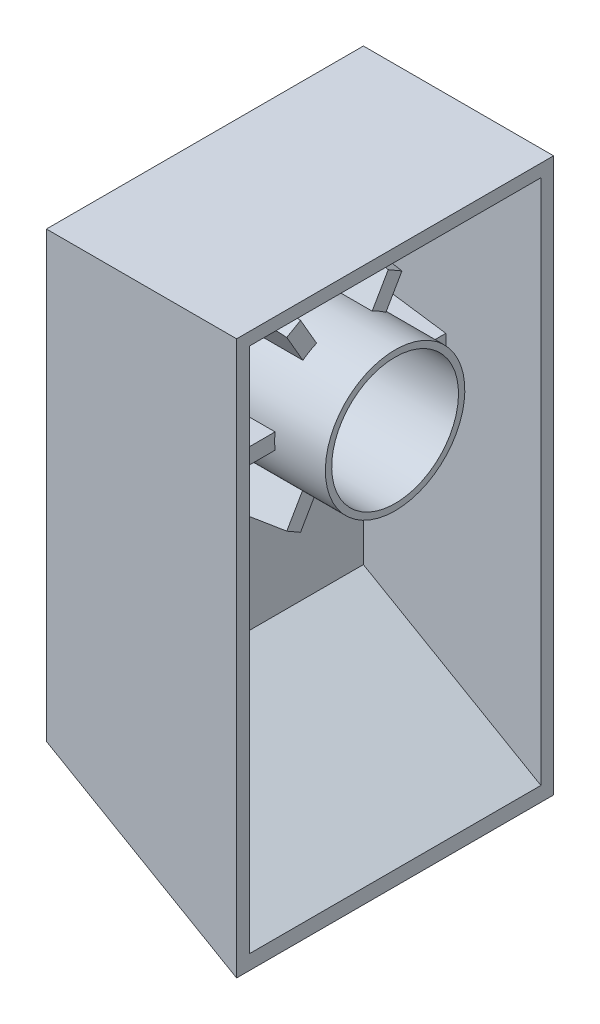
ISO-10303-21;
HEADER;
FILE_DESCRIPTION(('STEP AP214'),'2;1');
FILE_NAME('part.step','',(''),(''),'','','');
FILE_SCHEMA(('AUTOMOTIVE_DESIGN { 1 0 10303 214 1 1 1 1 }'));
ENDSEC;
DATA;
#1=APPLICATION_CONTEXT('core data for automotive mechanical design processes');
#2=APPLICATION_PROTOCOL_DEFINITION('international standard','automotive_design',2000,#1);
#3=PRODUCT_CONTEXT('',#1,'mechanical');
#4=PRODUCT('Part','Part','',(#3));
#5=PRODUCT_RELATED_PRODUCT_CATEGORY('part','',(#4));
#6=PRODUCT_DEFINITION_FORMATION('','',#4);
#7=PRODUCT_DEFINITION_CONTEXT('part definition',#1,'design');
#8=PRODUCT_DEFINITION('design','',#6,#7);
#9=PRODUCT_DEFINITION_SHAPE('','',#8);
#10=(LENGTH_UNIT() NAMED_UNIT(*) SI_UNIT(.MILLI.,.METRE.));
#11=(NAMED_UNIT(*) PLANE_ANGLE_UNIT() SI_UNIT($,.RADIAN.));
#12=(NAMED_UNIT(*) SI_UNIT($,.STERADIAN.) SOLID_ANGLE_UNIT());
#13=UNCERTAINTY_MEASURE_WITH_UNIT(LENGTH_MEASURE(1.E-05),#10,'distance_accuracy_value','');
#14=(GEOMETRIC_REPRESENTATION_CONTEXT(3) GLOBAL_UNCERTAINTY_ASSIGNED_CONTEXT((#13)) GLOBAL_UNIT_ASSIGNED_CONTEXT((#10,
#11,#12)) REPRESENTATION_CONTEXT('',''));
#15=CARTESIAN_POINT('',(0.,0.,0.));
#16=DIRECTION('',(0.,0.,1.));
#17=DIRECTION('',(1.,0.,0.));
#18=AXIS2_PLACEMENT_3D('',#15,#16,#17);
#19=CARTESIAN_POINT('',(60.,140.,50.));
#20=DIRECTION('',(-1.,0.,0.));
#21=DIRECTION('',(0.,-1.,0.));
#22=AXIS2_PLACEMENT_3D('',#19,#20,#21);
#23=PLANE('',#22);
#24=DIRECTION('',(0.,1.,0.));
#25=VECTOR('',#24,1.);
#26=CARTESIAN_POINT('',(60.,140.,-50.));
#27=LINE('',#26,#25);
#28=CARTESIAN_POINT('',(60.,-34.6410161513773,-50.));
#29=VERTEX_POINT('',#28);
#30=CARTESIAN_POINT('',(60.,140.,-50.));
#31=VERTEX_POINT('',#30);
#32=EDGE_CURVE('E446',#29,#31,#27,.T.);
#33=ORIENTED_EDGE('',*,*,#32,.T.);
#34=DIRECTION('',(0.,0.,-1.));
#35=VECTOR('',#34,1.);
#36=CARTESIAN_POINT('',(60.,140.,50.));
#37=LINE('',#36,#35);
#38=CARTESIAN_POINT('',(60.,140.,50.));
#39=VERTEX_POINT('',#38);
#40=EDGE_CURVE('E456',#39,#31,#37,.T.);
#41=ORIENTED_EDGE('',*,*,#40,.F.);
#42=DIRECTION('',(0.,1.,0.));
#43=VECTOR('',#42,1.);
#44=CARTESIAN_POINT('',(60.,140.,50.));
#45=LINE('',#44,#43);
#46=CARTESIAN_POINT('',(60.,-34.6410161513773,50.));
#47=VERTEX_POINT('',#46);
#48=EDGE_CURVE('E437',#47,#39,#45,.T.);
#49=ORIENTED_EDGE('',*,*,#48,.F.);
#50=DIRECTION('',(0.,0.,-1.));
#51=VECTOR('',#50,1.);
#52=CARTESIAN_POINT('',(60.,-34.6410161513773,50.));
#53=LINE('',#52,#51);
#54=EDGE_CURVE('E459',#47,#29,#53,.T.);
#55=ORIENTED_EDGE('',*,*,#54,.T.);
#56=EDGE_LOOP('',(#33,#41,#49,#55));
#57=FACE_BOUND('',#56,.T.);
#58=DIRECTION('',(0.,1.,0.));
#59=VECTOR('',#58,1.);
#60=CARTESIAN_POINT('',(60.,0.,-46.));
#61=LINE('',#60,#59);
#62=CARTESIAN_POINT('',(60.,-30.0222139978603,-46.));
#63=VERTEX_POINT('',#62);
#64=CARTESIAN_POINT('',(60.,136.,-46.));
#65=VERTEX_POINT('',#64);
#66=EDGE_CURVE('E395',#63,#65,#61,.T.);
#67=ORIENTED_EDGE('',*,*,#66,.F.);
#68=DIRECTION('',(0.,0.,-1.));
#69=VECTOR('',#68,1.);
#70=CARTESIAN_POINT('',(60.,-30.0222139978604,50.));
#71=LINE('',#70,#69);
#72=CARTESIAN_POINT('',(60.,-30.0222139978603,46.));
#73=VERTEX_POINT('',#72);
#74=EDGE_CURVE('E419',#73,#63,#71,.T.);
#75=ORIENTED_EDGE('',*,*,#74,.F.);
#76=DIRECTION('',(0.,1.,0.));
#77=VECTOR('',#76,1.);
#78=CARTESIAN_POINT('',(60.,0.,46.));
#79=LINE('',#78,#77);
#80=CARTESIAN_POINT('',(60.,136.,46.));
#81=VERTEX_POINT('',#80);
#82=EDGE_CURVE('E399',#73,#81,#79,.T.);
#83=ORIENTED_EDGE('',*,*,#82,.T.);
#84=DIRECTION('',(0.,0.,-1.));
#85=VECTOR('',#84,1.);
#86=CARTESIAN_POINT('',(60.,136.,50.));
#87=LINE('',#86,#85);
#88=EDGE_CURVE('E415',#81,#65,#87,.T.);
#89=ORIENTED_EDGE('',*,*,#88,.T.);
#90=EDGE_LOOP('',(#67,#75,#83,#89));
#91=FACE_BOUND('',#90,.T.);
#92=ADVANCED_FACE('F44',(#57,#91),#23,.F.);
#93=CARTESIAN_POINT('',(60.,-34.6410161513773,50.));
#94=DIRECTION('',(0.499999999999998,0.86602540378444,0.));
#95=DIRECTION('',(-0.86602540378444,0.499999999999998,0.));
#96=AXIS2_PLACEMENT_3D('',#93,#94,#95);
#97=PLANE('',#96);
#98=DIRECTION('',(0.,0.,-1.));
#99=VECTOR('',#98,1.);
#100=CARTESIAN_POINT('',(0.,0.,50.));
#101=LINE('',#100,#99);
#102=CARTESIAN_POINT('',(0.,0.,50.));
#103=VERTEX_POINT('',#102);
#104=CARTESIAN_POINT('',(0.,0.,-50.));
#105=VERTEX_POINT('',#104);
#106=EDGE_CURVE('E444',#103,#105,#101,.T.);
#107=ORIENTED_EDGE('',*,*,#106,.T.);
#108=DIRECTION('',(0.86602540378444,-0.499999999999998,0.));
#109=VECTOR('',#108,1.);
#110=CARTESIAN_POINT('',(60.,-34.6410161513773,-50.));
#111=LINE('',#110,#109);
#112=EDGE_CURVE('E432',#105,#29,#111,.T.);
#113=ORIENTED_EDGE('',*,*,#112,.T.);
#114=ORIENTED_EDGE('',*,*,#54,.F.);
#115=DIRECTION('',(0.86602540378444,-0.499999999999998,0.));
#116=VECTOR('',#115,1.);
#117=CARTESIAN_POINT('',(60.,-34.6410161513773,50.));
#118=LINE('',#117,#116);
#119=EDGE_CURVE('E435',#103,#47,#118,.T.);
#120=ORIENTED_EDGE('',*,*,#119,.F.);
#121=EDGE_LOOP('',(#107,#113,#114,#120));
#122=FACE_BOUND('',#121,.T.);
#123=ADVANCED_FACE('F46',(#122),#97,.F.);
#124=CARTESIAN_POINT('',(60.,90.,0.));
#125=DIRECTION('',(-1.,0.,0.));
#126=DIRECTION('',(0.,-1.,0.));
#127=AXIS2_PLACEMENT_3D('',#124,#125,#126);
#128=CIRCLE('',#127,22.);
#129=CARTESIAN_POINT('',(60.,68.,0.));
#130=VERTEX_POINT('',#129);
#131=EDGE_CURVE('E391',#130,#130,#128,.F.);
#132=ORIENTED_EDGE('',*,*,#131,.T.);
#133=EDGE_LOOP('',(#132));
#134=FACE_BOUND('',#133,.T.);
#135=CARTESIAN_POINT('',(60.,90.,0.));
#136=DIRECTION('',(1.,0.,0.));
#137=DIRECTION('',(0.,1.,0.));
#138=AXIS2_PLACEMENT_3D('',#135,#136,#137);
#139=CIRCLE('',#138,20.);
#140=CARTESIAN_POINT('',(60.,110.,0.));
#141=VERTEX_POINT('',#140);
#142=EDGE_CURVE('E421',#141,#141,#139,.T.);
#143=ORIENTED_EDGE('',*,*,#142,.F.);
#144=EDGE_LOOP('',(#143));
#145=FACE_BOUND('',#144,.T.);
#146=ADVANCED_FACE('F588',(#134,#145),#23,.F.);
#147=CARTESIAN_POINT('',(0.,140.,50.));
#148=DIRECTION('',(0.,-1.,0.));
#149=DIRECTION('',(0.,0.,-1.));
#150=AXIS2_PLACEMENT_3D('',#147,#148,#149);
#151=PLANE('',#150);
#152=DIRECTION('',(-1.,0.,0.));
#153=VECTOR('',#152,1.);
#154=CARTESIAN_POINT('',(0.,140.,-50.));
#155=LINE('',#154,#153);
#156=CARTESIAN_POINT('',(0.,140.,-50.));
#157=VERTEX_POINT('',#156);
#158=EDGE_CURVE('E448',#31,#157,#155,.T.);
#159=ORIENTED_EDGE('',*,*,#158,.T.);
#160=DIRECTION('',(0.,0.,-1.));
#161=VECTOR('',#160,1.);
#162=CARTESIAN_POINT('',(0.,140.,50.));
#163=LINE('',#162,#161);
#164=CARTESIAN_POINT('',(0.,140.,50.));
#165=VERTEX_POINT('',#164);
#166=EDGE_CURVE('E454',#165,#157,#163,.T.);
#167=ORIENTED_EDGE('',*,*,#166,.F.);
#168=DIRECTION('',(-1.,0.,0.));
#169=VECTOR('',#168,1.);
#170=CARTESIAN_POINT('',(0.,140.,50.));
#171=LINE('',#170,#169);
#172=EDGE_CURVE('E440',#39,#165,#171,.T.);
#173=ORIENTED_EDGE('',*,*,#172,.F.);
#174=ORIENTED_EDGE('',*,*,#40,.T.);
#175=EDGE_LOOP('',(#159,#167,#173,#174));
#176=FACE_BOUND('',#175,.T.);
#177=ADVANCED_FACE('F596',(#176),#151,.F.);
#178=CARTESIAN_POINT('',(0.,0.,50.));
#179=DIRECTION('',(1.,0.,0.));
#180=DIRECTION('',(0.,0.,-1.));
#181=AXIS2_PLACEMENT_3D('',#178,#179,#180);
#182=PLANE('',#181);
#183=CARTESIAN_POINT('',(0.,90.,0.));
#184=DIRECTION('',(1.,0.,0.));
#185=DIRECTION('',(0.,1.,0.));
#186=AXIS2_PLACEMENT_3D('',#183,#184,#185);
#187=CIRCLE('',#186,20.);
#188=CARTESIAN_POINT('',(0.,110.,0.));
#189=VERTEX_POINT('',#188);
#190=EDGE_CURVE('E429',#189,#189,#187,.T.);
#191=ORIENTED_EDGE('',*,*,#190,.T.);
#192=EDGE_LOOP('',(#191));
#193=FACE_BOUND('',#192,.T.);
#194=ORIENTED_EDGE('',*,*,#166,.T.);
#195=DIRECTION('',(0.,-1.,0.));
#196=VECTOR('',#195,1.);
#197=CARTESIAN_POINT('',(0.,0.,-50.));
#198=LINE('',#197,#196);
#199=EDGE_CURVE('E438',#157,#105,#198,.T.);
#200=ORIENTED_EDGE('',*,*,#199,.T.);
#201=ORIENTED_EDGE('',*,*,#106,.F.);
#202=DIRECTION('',(0.,-1.,0.));
#203=VECTOR('',#202,1.);
#204=CARTESIAN_POINT('',(0.,0.,50.));
#205=LINE('',#204,#203);
#206=EDGE_CURVE('E442',#165,#103,#205,.T.);
#207=ORIENTED_EDGE('',*,*,#206,.F.);
#208=EDGE_LOOP('',(#194,#200,#201,#207));
#209=FACE_BOUND('',#208,.T.);
#210=ADVANCED_FACE('F601',(#193,#209),#182,.F.);
#211=CARTESIAN_POINT('',(0.,0.,50.));
#212=DIRECTION('',(0.,0.,-1.));
#213=DIRECTION('',(-1.,0.,0.));
#214=AXIS2_PLACEMENT_3D('',#211,#212,#213);
#215=PLANE('',#214);
#216=ORIENTED_EDGE('',*,*,#206,.T.);
#217=ORIENTED_EDGE('',*,*,#119,.T.);
#218=ORIENTED_EDGE('',*,*,#48,.T.);
#219=ORIENTED_EDGE('',*,*,#172,.T.);
#220=EDGE_LOOP('',(#216,#217,#218,#219));
#221=FACE_BOUND('',#220,.T.);
#222=ADVANCED_FACE('F620',(#221),#215,.F.);
#223=CARTESIAN_POINT('',(0.,0.,-50.));
#224=DIRECTION('',(0.,0.,-1.));
#225=DIRECTION('',(-1.,0.,0.));
#226=AXIS2_PLACEMENT_3D('',#223,#224,#225);
#227=PLANE('',#226);
#228=ORIENTED_EDGE('',*,*,#112,.F.);
#229=ORIENTED_EDGE('',*,*,#199,.F.);
#230=ORIENTED_EDGE('',*,*,#158,.F.);
#231=ORIENTED_EDGE('',*,*,#32,.F.);
#232=EDGE_LOOP('',(#228,#229,#230,#231));
#233=FACE_BOUND('',#232,.T.);
#234=ADVANCED_FACE('F610',(#233),#227,.T.);
#235=CARTESIAN_POINT('',(0.,90.,0.));
#236=DIRECTION('',(1.,0.,0.));
#237=DIRECTION('',(0.,1.,0.));
#238=AXIS2_PLACEMENT_3D('',#235,#236,#237);
#239=CYLINDRICAL_SURFACE('',#238,20.);
#240=ORIENTED_EDGE('',*,*,#190,.F.);
#241=EDGE_LOOP('',(#240));
#242=FACE_BOUND('',#241,.T.);
#243=ORIENTED_EDGE('',*,*,#142,.T.);
#244=EDGE_LOOP('',(#243));
#245=FACE_BOUND('',#244,.T.);
#246=ADVANCED_FACE('F607',(#242,#245),#239,.F.);
#247=CARTESIAN_POINT('',(62.,-31.1769145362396,50.));
#248=DIRECTION('',(0.499999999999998,0.86602540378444,0.));
#249=DIRECTION('',(-0.86602540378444,0.499999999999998,0.));
#250=AXIS2_PLACEMENT_3D('',#247,#248,#249);
#251=PLANE('',#250);
#252=DIRECTION('',(0.86602540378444,-0.499999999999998,0.));
#253=VECTOR('',#252,1.);
#254=CARTESIAN_POINT('',(1.99999999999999,3.46410161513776,-46.));
#255=LINE('',#254,#253);
#256=CARTESIAN_POINT('',(4.,2.30940107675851,-46.));
#257=VERTEX_POINT('',#256);
#258=EDGE_CURVE('E392',#257,#63,#255,.T.);
#259=ORIENTED_EDGE('',*,*,#258,.F.);
#260=DIRECTION('',(0.,0.,-1.));
#261=VECTOR('',#260,1.);
#262=CARTESIAN_POINT('',(4.,2.30940107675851,50.));
#263=LINE('',#262,#261);
#264=CARTESIAN_POINT('',(4.,2.30940107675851,46.));
#265=VERTEX_POINT('',#264);
#266=EDGE_CURVE('E401',#265,#257,#263,.T.);
#267=ORIENTED_EDGE('',*,*,#266,.F.);
#268=DIRECTION('',(0.86602540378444,-0.499999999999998,0.));
#269=VECTOR('',#268,1.);
#270=CARTESIAN_POINT('',(1.99999999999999,3.46410161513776,46.));
#271=LINE('',#270,#269);
#272=EDGE_CURVE('E397',#265,#73,#271,.T.);
#273=ORIENTED_EDGE('',*,*,#272,.T.);
#274=ORIENTED_EDGE('',*,*,#74,.T.);
#275=EDGE_LOOP('',(#259,#267,#273,#274));
#276=FACE_BOUND('',#275,.T.);
#277=ADVANCED_FACE('F609',(#276),#251,.T.);
#278=CARTESIAN_POINT('',(0.,136.,50.));
#279=DIRECTION('',(0.,-1.,0.));
#280=DIRECTION('',(0.,0.,-1.));
#281=AXIS2_PLACEMENT_3D('',#278,#279,#280);
#282=PLANE('',#281);
#283=DIRECTION('',(0.,0.,-1.));
#284=VECTOR('',#283,1.);
#285=CARTESIAN_POINT('',(4.,136.,50.));
#286=LINE('',#285,#284);
#287=CARTESIAN_POINT('',(4.,136.,46.));
#288=VERTEX_POINT('',#287);
#289=CARTESIAN_POINT('',(4.,136.,-46.));
#290=VERTEX_POINT('',#289);
#291=EDGE_CURVE('E404',#288,#290,#286,.T.);
#292=ORIENTED_EDGE('',*,*,#291,.T.);
#293=DIRECTION('',(-1.,0.,0.));
#294=VECTOR('',#293,1.);
#295=CARTESIAN_POINT('',(0.,136.,-46.));
#296=LINE('',#295,#294);
#297=EDGE_CURVE('E411',#65,#290,#296,.T.);
#298=ORIENTED_EDGE('',*,*,#297,.F.);
#299=ORIENTED_EDGE('',*,*,#88,.F.);
#300=DIRECTION('',(-1.,0.,0.));
#301=VECTOR('',#300,1.);
#302=CARTESIAN_POINT('',(0.,136.,46.));
#303=LINE('',#302,#301);
#304=EDGE_CURVE('E413',#81,#288,#303,.T.);
#305=ORIENTED_EDGE('',*,*,#304,.T.);
#306=EDGE_LOOP('',(#292,#298,#299,#305));
#307=FACE_BOUND('',#306,.T.);
#308=ADVANCED_FACE('F617',(#307),#282,.T.);
#309=CARTESIAN_POINT('',(4.,0.,50.));
#310=DIRECTION('',(1.,0.,0.));
#311=DIRECTION('',(0.,0.,-1.));
#312=AXIS2_PLACEMENT_3D('',#309,#310,#311);
#313=PLANE('',#312);
#314=DIRECTION('',(0.,-1.,0.));
#315=VECTOR('',#314,1.);
#316=CARTESIAN_POINT('',(4.,0.,-46.));
#317=LINE('',#316,#315);
#318=EDGE_CURVE('E400',#290,#257,#317,.T.);
#319=ORIENTED_EDGE('',*,*,#318,.F.);
#320=ORIENTED_EDGE('',*,*,#291,.F.);
#321=DIRECTION('',(0.,-1.,0.));
#322=VECTOR('',#321,1.);
#323=CARTESIAN_POINT('',(4.,0.,46.));
#324=LINE('',#323,#322);
#325=EDGE_CURVE('E405',#288,#265,#324,.T.);
#326=ORIENTED_EDGE('',*,*,#325,.T.);
#327=ORIENTED_EDGE('',*,*,#266,.T.);
#328=EDGE_LOOP('',(#319,#320,#326,#327));
#329=FACE_BOUND('',#328,.T.);
#330=DIRECTION('',(0.,-0.500000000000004,0.866025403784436));
#331=VECTOR('',#330,1.);
#332=CARTESIAN_POINT('',(4.,77.8923048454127,94.9711431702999));
#333=LINE('',#332,#331);
#334=CARTESIAN_POINT('',(4.00000000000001,123.292939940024,16.3349364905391));
#335=VERTEX_POINT('',#334);
#336=CARTESIAN_POINT('',(4.00000000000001,120.792939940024,20.6650635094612));
#337=VERTEX_POINT('',#336);
#338=EDGE_CURVE('E490',#335,#337,#333,.T.);
#339=ORIENTED_EDGE('',*,*,#338,.F.);
#340=DIRECTION('',(0.,-0.866025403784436,-0.500000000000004));
#341=VECTOR('',#340,1.);
#342=CARTESIAN_POINT('',(4.,45.4006350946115,-28.6362066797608));
#343=LINE('',#342,#341);
#344=CARTESIAN_POINT('',(4.,110.179144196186,8.76368298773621));
#345=VERTEX_POINT('',#344);
#346=EDGE_CURVE('E350',#335,#345,#343,.T.);
#347=ORIENTED_EDGE('',*,*,#346,.T.);
#348=CARTESIAN_POINT('',(4.,90.,0.));
#349=DIRECTION('',(1.,0.,0.));
#350=DIRECTION('',(0.,0.,-1.));
#351=AXIS2_PLACEMENT_3D('',#348,#349,#350);
#352=CIRCLE('',#351,22.);
#353=CARTESIAN_POINT('',(4.,110.179144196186,-8.76368298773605));
#354=VERTEX_POINT('',#353);
#355=EDGE_CURVE('E408',#354,#345,#352,.T.);
#356=ORIENTED_EDGE('',*,*,#355,.F.);
#357=DIRECTION('',(0.,-0.86602540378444,0.499999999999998));
#358=VECTOR('',#357,1.);
#359=CARTESIAN_POINT('',(4.,2.09936490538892,53.6362066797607));
#360=LINE('',#359,#358);
#361=CARTESIAN_POINT('',(4.,123.292939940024,-16.3349364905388));
#362=VERTEX_POINT('',#361);
#363=EDGE_CURVE('E371',#362,#354,#360,.T.);
#364=ORIENTED_EDGE('',*,*,#363,.F.);
#365=DIRECTION('',(0.,0.499999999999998,0.86602540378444));
#366=VECTOR('',#365,1.);
#367=CARTESIAN_POINT('',(4.,121.193575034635,-19.9711431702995));
#368=LINE('',#367,#366);
#369=CARTESIAN_POINT('',(4.,120.792939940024,-20.665063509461));
#370=VERTEX_POINT('',#369);
#371=EDGE_CURVE('E480',#370,#362,#368,.T.);
#372=ORIENTED_EDGE('',*,*,#371,.F.);
#373=DIRECTION('',(0.,-0.86602540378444,0.499999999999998));
#374=VECTOR('',#373,1.);
#375=CARTESIAN_POINT('',(4.,-0.400635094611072,49.3060796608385));
#376=LINE('',#375,#374);
#377=CARTESIAN_POINT('',(4.,107.679144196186,-13.0938100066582));
#378=VERTEX_POINT('',#377);
#379=EDGE_CURVE('E368',#370,#378,#376,.T.);
#380=ORIENTED_EDGE('',*,*,#379,.T.);
#381=CARTESIAN_POINT('',(4.,92.5,-21.8574929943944));
#382=VERTEX_POINT('',#381);
#383=EDGE_CURVE('E396',#382,#378,#352,.T.);
#384=ORIENTED_EDGE('',*,*,#383,.F.);
#385=DIRECTION('',(0.,0.,1.));
#386=VECTOR('',#385,1.);
#387=CARTESIAN_POINT('',(4.,92.5,50.));
#388=LINE('',#387,#386);
#389=CARTESIAN_POINT('',(4.,92.5,-37.));
#390=VERTEX_POINT('',#389);
#391=EDGE_CURVE('E389',#390,#382,#388,.T.);
#392=ORIENTED_EDGE('',*,*,#391,.F.);
#393=DIRECTION('',(0.,1.,0.));
#394=VECTOR('',#393,1.);
#395=CARTESIAN_POINT('',(4.,0.,-37.));
#396=LINE('',#395,#394);
#397=CARTESIAN_POINT('',(4.,87.5,-37.));
#398=VERTEX_POINT('',#397);
#399=EDGE_CURVE('E470',#398,#390,#396,.T.);
#400=ORIENTED_EDGE('',*,*,#399,.F.);
#401=DIRECTION('',(0.,0.,1.));
#402=VECTOR('',#401,1.);
#403=CARTESIAN_POINT('',(4.,87.5,50.));
#404=LINE('',#403,#402);
#405=CARTESIAN_POINT('',(4.,87.5,-21.8574929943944));
#406=VERTEX_POINT('',#405);
#407=EDGE_CURVE('E386',#398,#406,#404,.T.);
#408=ORIENTED_EDGE('',*,*,#407,.T.);
#409=CARTESIAN_POINT('',(4.,72.3208558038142,-13.0938100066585));
#410=VERTEX_POINT('',#409);
#411=EDGE_CURVE('E409',#410,#406,#352,.T.);
#412=ORIENTED_EDGE('',*,*,#411,.F.);
#413=DIRECTION('',(0.,0.866025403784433,0.50000000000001));
#414=VECTOR('',#413,1.);
#415=CARTESIAN_POINT('',(4.,45.4006350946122,-28.6362066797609));
#416=LINE('',#415,#414);
#417=CARTESIAN_POINT('',(4.,59.207060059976,-20.6650635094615));
#418=VERTEX_POINT('',#417);
#419=EDGE_CURVE('E276',#418,#410,#416,.T.);
#420=ORIENTED_EDGE('',*,*,#419,.F.);
#421=DIRECTION('',(0.,0.50000000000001,-0.866025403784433));
#422=VECTOR('',#421,1.);
#423=CARTESIAN_POINT('',(4.,13.8064249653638,57.9711431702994));
#424=LINE('',#423,#422);
#425=CARTESIAN_POINT('',(4.,56.707060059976,-16.3349364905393));
#426=VERTEX_POINT('',#425);
#427=EDGE_CURVE('E13',#426,#418,#424,.T.);
#428=ORIENTED_EDGE('',*,*,#427,.F.);
#429=DIRECTION('',(0.,0.866025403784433,0.50000000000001));
#430=VECTOR('',#429,1.);
#431=CARTESIAN_POINT('',(4.,42.9006350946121,-24.3060796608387));
#432=LINE('',#431,#430);
#433=CARTESIAN_POINT('',(4.,69.8208558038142,-8.76368298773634));
#434=VERTEX_POINT('',#433);
#435=EDGE_CURVE('E282',#426,#434,#432,.T.);
#436=ORIENTED_EDGE('',*,*,#435,.T.);
#437=CARTESIAN_POINT('',(4.,69.820855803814,8.76368298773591));
#438=VERTEX_POINT('',#437);
#439=EDGE_CURVE('E508',#438,#434,#352,.T.);
#440=ORIENTED_EDGE('',*,*,#439,.F.);
#441=DIRECTION('',(0.,0.866025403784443,-0.499999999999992));
#442=VECTOR('',#441,1.);
#443=CARTESIAN_POINT('',(4.,-0.400635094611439,49.3060796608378));
#444=LINE('',#443,#442);
#445=CARTESIAN_POINT('',(4.,56.7070600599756,16.3349364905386));
#446=VERTEX_POINT('',#445);
#447=EDGE_CURVE('E300',#446,#438,#444,.T.);
#448=ORIENTED_EDGE('',*,*,#447,.F.);
#449=DIRECTION('',(0.,-0.499999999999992,-0.866025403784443));
#450=VECTOR('',#449,1.);
#451=CARTESIAN_POINT('',(4.,57.1076951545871,17.0288568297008));
#452=LINE('',#451,#450);
#453=CARTESIAN_POINT('',(4.,59.2070600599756,20.6650635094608));
#454=VERTEX_POINT('',#453);
#455=EDGE_CURVE('E52',#454,#446,#452,.T.);
#456=ORIENTED_EDGE('',*,*,#455,.F.);
#457=DIRECTION('',(0.,0.866025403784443,-0.499999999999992));
#458=VECTOR('',#457,1.);
#459=CARTESIAN_POINT('',(4.,2.09936490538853,53.63620667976));
#460=LINE('',#459,#458);
#461=CARTESIAN_POINT('',(4.,72.320855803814,13.0938100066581));
#462=VERTEX_POINT('',#461);
#463=EDGE_CURVE('E306',#454,#462,#460,.T.);
#464=ORIENTED_EDGE('',*,*,#463,.T.);
#465=CARTESIAN_POINT('',(4.,87.5,21.8574929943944));
#466=VERTEX_POINT('',#465);
#467=EDGE_CURVE('E510',#466,#462,#352,.T.);
#468=ORIENTED_EDGE('',*,*,#467,.F.);
#469=DIRECTION('',(0.,0.,-1.));
#470=VECTOR('',#469,1.);
#471=CARTESIAN_POINT('',(4.,87.5,50.));
#472=LINE('',#471,#470);
#473=CARTESIAN_POINT('',(4.,87.5,37.));
#474=VERTEX_POINT('',#473);
#475=EDGE_CURVE('E325',#474,#466,#472,.T.);
#476=ORIENTED_EDGE('',*,*,#475,.F.);
#477=DIRECTION('',(0.,-1.,0.));
#478=VECTOR('',#477,1.);
#479=CARTESIAN_POINT('',(4.,0.,37.));
#480=LINE('',#479,#478);
#481=CARTESIAN_POINT('',(4.,92.5,37.));
#482=VERTEX_POINT('',#481);
#483=EDGE_CURVE('E492',#482,#474,#480,.T.);
#484=ORIENTED_EDGE('',*,*,#483,.F.);
#485=DIRECTION('',(0.,0.,-1.));
#486=VECTOR('',#485,1.);
#487=CARTESIAN_POINT('',(4.,92.5,50.));
#488=LINE('',#487,#486);
#489=CARTESIAN_POINT('',(4.,92.5,21.8574929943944));
#490=VERTEX_POINT('',#489);
#491=EDGE_CURVE('E332',#482,#490,#488,.T.);
#492=ORIENTED_EDGE('',*,*,#491,.T.);
#493=CARTESIAN_POINT('',(4.,107.679144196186,13.0938100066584));
#494=VERTEX_POINT('',#493);
#495=EDGE_CURVE('E512',#494,#490,#352,.T.);
#496=ORIENTED_EDGE('',*,*,#495,.F.);
#497=DIRECTION('',(0.,-0.866025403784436,-0.500000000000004));
#498=VECTOR('',#497,1.);
#499=CARTESIAN_POINT('',(4.,42.9006350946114,-24.3060796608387));
#500=LINE('',#499,#498);
#501=EDGE_CURVE('E353',#337,#494,#500,.T.);
#502=ORIENTED_EDGE('',*,*,#501,.F.);
#503=EDGE_LOOP('',(#339,#347,#356,#364,#372,#380,#384,#392,#400,#408,#412,#420,#428,#436,#440,
#448,#456,#464,#468,#476,#484,#492,#496,#502));
#504=FACE_BOUND('',#503,.T.);
#505=ADVANCED_FACE('F506',(#329,#504),#313,.T.);
#506=CARTESIAN_POINT('',(0.,0.,46.));
#507=DIRECTION('',(0.,0.,-1.));
#508=DIRECTION('',(-1.,0.,0.));
#509=AXIS2_PLACEMENT_3D('',#506,#507,#508);
#510=PLANE('',#509);
#511=ORIENTED_EDGE('',*,*,#272,.F.);
#512=ORIENTED_EDGE('',*,*,#325,.F.);
#513=ORIENTED_EDGE('',*,*,#304,.F.);
#514=ORIENTED_EDGE('',*,*,#82,.F.);
#515=EDGE_LOOP('',(#511,#512,#513,#514));
#516=FACE_BOUND('',#515,.T.);
#517=ADVANCED_FACE('F681',(#516),#510,.T.);
#518=CARTESIAN_POINT('',(0.,0.,-46.));
#519=DIRECTION('',(0.,0.,-1.));
#520=DIRECTION('',(-1.,0.,0.));
#521=AXIS2_PLACEMENT_3D('',#518,#519,#520);
#522=PLANE('',#521);
#523=ORIENTED_EDGE('',*,*,#318,.T.);
#524=ORIENTED_EDGE('',*,*,#258,.T.);
#525=ORIENTED_EDGE('',*,*,#66,.T.);
#526=ORIENTED_EDGE('',*,*,#297,.T.);
#527=EDGE_LOOP('',(#523,#524,#525,#526));
#528=FACE_BOUND('',#527,.T.);
#529=ADVANCED_FACE('F691',(#528),#522,.F.);
#530=CARTESIAN_POINT('',(0.,90.,0.));
#531=DIRECTION('',(1.,0.,0.));
#532=DIRECTION('',(0.,1.,0.));
#533=AXIS2_PLACEMENT_3D('',#530,#531,#532);
#534=CYLINDRICAL_SURFACE('',#533,22.);
#535=DIRECTION('',(1.,0.,0.));
#536=VECTOR('',#535,1.);
#537=CARTESIAN_POINT('',(0.,72.3208558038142,-13.0938100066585));
#538=LINE('',#537,#536);
#539=CARTESIAN_POINT('',(44.,72.3208558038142,-13.0938100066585));
#540=VERTEX_POINT('',#539);
#541=EDGE_CURVE('E259',#410,#540,#538,.T.);
#542=ORIENTED_EDGE('',*,*,#541,.F.);
#543=ORIENTED_EDGE('',*,*,#411,.T.);
#544=DIRECTION('',(1.,0.,0.));
#545=VECTOR('',#544,1.);
#546=CARTESIAN_POINT('',(0.,87.5,-21.8574929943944));
#547=LINE('',#546,#545);
#548=CARTESIAN_POINT('',(44.0000000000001,87.5,-21.8574929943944));
#549=VERTEX_POINT('',#548);
#550=EDGE_CURVE('E462',#406,#549,#547,.T.);
#551=ORIENTED_EDGE('',*,*,#550,.T.);
#552=CARTESIAN_POINT('',(44.,90.,0.));
#553=DIRECTION('',(1.,0.,0.));
#554=DIRECTION('',(0.,0.,-1.));
#555=AXIS2_PLACEMENT_3D('',#552,#553,#554);
#556=CIRCLE('',#555,22.);
#557=CARTESIAN_POINT('',(44.0000000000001,92.5,-21.8574929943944));
#558=VERTEX_POINT('',#557);
#559=EDGE_CURVE('E465',#558,#549,#556,.F.);
#560=ORIENTED_EDGE('',*,*,#559,.F.);
#561=DIRECTION('',(1.,0.,0.));
#562=VECTOR('',#561,1.);
#563=CARTESIAN_POINT('',(0.,92.5,-21.8574929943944));
#564=LINE('',#563,#562);
#565=EDGE_CURVE('E468',#382,#558,#564,.T.);
#566=ORIENTED_EDGE('',*,*,#565,.F.);
#567=ORIENTED_EDGE('',*,*,#383,.T.);
#568=DIRECTION('',(1.,0.,0.));
#569=VECTOR('',#568,1.);
#570=CARTESIAN_POINT('',(0.,107.679144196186,-13.0938100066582));
#571=LINE('',#570,#569);
#572=CARTESIAN_POINT('',(44.0000000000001,107.679144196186,-13.0938100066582));
#573=VERTEX_POINT('',#572);
#574=EDGE_CURVE('E472',#378,#573,#571,.T.);
#575=ORIENTED_EDGE('',*,*,#574,.T.);
#576=CARTESIAN_POINT('',(44.,90.,0.));
#577=DIRECTION('',(1.,0.,0.));
#578=DIRECTION('',(0.,1.,0.));
#579=AXIS2_PLACEMENT_3D('',#576,#577,#578);
#580=CIRCLE('',#579,22.);
#581=CARTESIAN_POINT('',(44.0000000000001,110.179144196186,-8.76368298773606));
#582=VERTEX_POINT('',#581);
#583=EDGE_CURVE('E475',#582,#573,#580,.F.);
#584=ORIENTED_EDGE('',*,*,#583,.F.);
#585=DIRECTION('',(1.,0.,0.));
#586=VECTOR('',#585,1.);
#587=CARTESIAN_POINT('',(0.,110.179144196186,-8.76368298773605));
#588=LINE('',#587,#586);
#589=EDGE_CURVE('E478',#354,#582,#588,.T.);
#590=ORIENTED_EDGE('',*,*,#589,.F.);
#591=ORIENTED_EDGE('',*,*,#355,.T.);
#592=DIRECTION('',(1.,0.,0.));
#593=VECTOR('',#592,1.);
#594=CARTESIAN_POINT('',(0.,110.179144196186,8.76368298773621));
#595=LINE('',#594,#593);
#596=CARTESIAN_POINT('',(44.0000000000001,110.179144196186,8.76368298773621));
#597=VERTEX_POINT('',#596);
#598=EDGE_CURVE('E482',#345,#597,#595,.T.);
#599=ORIENTED_EDGE('',*,*,#598,.T.);
#600=CARTESIAN_POINT('',(44.,90.,0.));
#601=DIRECTION('',(1.,0.,0.));
#602=DIRECTION('',(0.,1.,0.));
#603=AXIS2_PLACEMENT_3D('',#600,#601,#602);
#604=CIRCLE('',#603,22.);
#605=CARTESIAN_POINT('',(44.0000000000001,107.679144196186,13.0938100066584));
#606=VERTEX_POINT('',#605);
#607=EDGE_CURVE('E485',#606,#597,#604,.F.);
#608=ORIENTED_EDGE('',*,*,#607,.F.);
#609=DIRECTION('',(1.,0.,0.));
#610=VECTOR('',#609,1.);
#611=CARTESIAN_POINT('',(0.,107.679144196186,13.0938100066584));
#612=LINE('',#611,#610);
#613=EDGE_CURVE('E488',#494,#606,#612,.T.);
#614=ORIENTED_EDGE('',*,*,#613,.F.);
#615=ORIENTED_EDGE('',*,*,#495,.T.);
#616=DIRECTION('',(1.,0.,0.));
#617=VECTOR('',#616,1.);
#618=CARTESIAN_POINT('',(0.,92.5,21.8574929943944));
#619=LINE('',#618,#617);
#620=CARTESIAN_POINT('',(44.0000000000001,92.5,21.8574929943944));
#621=VERTEX_POINT('',#620);
#622=EDGE_CURVE('E331',#490,#621,#619,.T.);
#623=ORIENTED_EDGE('',*,*,#622,.T.);
#624=CARTESIAN_POINT('',(44.,90.,0.));
#625=DIRECTION('',(1.,0.,0.));
#626=DIRECTION('',(0.,0.,-1.));
#627=AXIS2_PLACEMENT_3D('',#624,#625,#626);
#628=CIRCLE('',#627,22.);
#629=CARTESIAN_POINT('',(44.0000000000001,87.5,21.8574929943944));
#630=VERTEX_POINT('',#629);
#631=EDGE_CURVE('E327',#630,#621,#628,.F.);
#632=ORIENTED_EDGE('',*,*,#631,.F.);
#633=DIRECTION('',(1.,0.,0.));
#634=VECTOR('',#633,1.);
#635=CARTESIAN_POINT('',(0.,87.5,21.8574929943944));
#636=LINE('',#635,#634);
#637=EDGE_CURVE('E324',#466,#630,#636,.T.);
#638=ORIENTED_EDGE('',*,*,#637,.F.);
#639=ORIENTED_EDGE('',*,*,#467,.T.);
#640=DIRECTION('',(1.,0.,0.));
#641=VECTOR('',#640,1.);
#642=CARTESIAN_POINT('',(0.,72.320855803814,13.0938100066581));
#643=LINE('',#642,#641);
#644=CARTESIAN_POINT('',(44.,72.320855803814,13.0938100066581));
#645=VERTEX_POINT('',#644);
#646=EDGE_CURVE('E305',#462,#645,#643,.T.);
#647=ORIENTED_EDGE('',*,*,#646,.T.);
#648=CARTESIAN_POINT('',(44.,90.,0.));
#649=DIRECTION('',(1.,0.,0.));
#650=DIRECTION('',(0.,0.,-1.));
#651=AXIS2_PLACEMENT_3D('',#648,#649,#650);
#652=CIRCLE('',#651,22.);
#653=CARTESIAN_POINT('',(44.,69.820855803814,8.76368298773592));
#654=VERTEX_POINT('',#653);
#655=EDGE_CURVE('E302',#654,#645,#652,.F.);
#656=ORIENTED_EDGE('',*,*,#655,.F.);
#657=DIRECTION('',(1.,0.,0.));
#658=VECTOR('',#657,1.);
#659=CARTESIAN_POINT('',(0.,69.820855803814,8.76368298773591));
#660=LINE('',#659,#658);
#661=EDGE_CURVE('E299',#438,#654,#660,.T.);
#662=ORIENTED_EDGE('',*,*,#661,.F.);
#663=ORIENTED_EDGE('',*,*,#439,.T.);
#664=DIRECTION('',(1.,0.,0.));
#665=VECTOR('',#664,1.);
#666=CARTESIAN_POINT('',(0.,69.8208558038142,-8.76368298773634));
#667=LINE('',#666,#665);
#668=CARTESIAN_POINT('',(44.,69.8208558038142,-8.76368298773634));
#669=VERTEX_POINT('',#668);
#670=EDGE_CURVE('E281',#434,#669,#667,.T.);
#671=ORIENTED_EDGE('',*,*,#670,.T.);
#672=CARTESIAN_POINT('',(44.,90.,0.));
#673=DIRECTION('',(1.,0.,0.));
#674=DIRECTION('',(0.,1.,0.));
#675=AXIS2_PLACEMENT_3D('',#672,#673,#674);
#676=CIRCLE('',#675,22.);
#677=EDGE_CURVE('E278',#540,#669,#676,.F.);
#678=ORIENTED_EDGE('',*,*,#677,.F.);
#679=EDGE_LOOP('',(#542,#543,#551,#560,#566,#567,#575,#584,#590,#591,#599,#608,#614,#615,#623,
#632,#638,#639,#647,#656,#662,#663,#671,#678));
#680=FACE_BOUND('',#679,.T.);
#681=ORIENTED_EDGE('',*,*,#131,.F.);
#682=EDGE_LOOP('',(#681));
#683=FACE_BOUND('',#682,.T.);
#684=ADVANCED_FACE('F515',(#680,#683),#534,.T.);
#685=CARTESIAN_POINT('',(44.,90.,-32.));
#686=DIRECTION('',(0.124034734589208,0.,-0.992277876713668));
#687=DIRECTION('',(-0.992277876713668,0.,-0.124034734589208));
#688=AXIS2_PLACEMENT_3D('',#685,#686,#687);
#689=PLANE('',#688);
#690=DIRECTION('',(-0.992277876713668,0.,-0.124034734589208));
#691=VECTOR('',#690,1.);
#692=CARTESIAN_POINT('',(44.,87.5,-32.));
#693=LINE('',#692,#691);
#694=CARTESIAN_POINT('',(44.,87.5,-32.));
#695=VERTEX_POINT('',#694);
#696=EDGE_CURVE('E373',#695,#398,#693,.T.);
#697=ORIENTED_EDGE('',*,*,#696,.T.);
#698=ORIENTED_EDGE('',*,*,#399,.T.);
#699=DIRECTION('',(-0.992277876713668,0.,-0.124034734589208));
#700=VECTOR('',#699,1.);
#701=CARTESIAN_POINT('',(44.,92.5,-32.));
#702=LINE('',#701,#700);
#703=CARTESIAN_POINT('',(44.,92.5,-32.));
#704=VERTEX_POINT('',#703);
#705=EDGE_CURVE('E374',#704,#390,#702,.T.);
#706=ORIENTED_EDGE('',*,*,#705,.F.);
#707=DIRECTION('',(0.,1.,0.));
#708=VECTOR('',#707,1.);
#709=CARTESIAN_POINT('',(44.,90.,-32.));
#710=LINE('',#709,#708);
#711=EDGE_CURVE('E380',#695,#704,#710,.T.);
#712=ORIENTED_EDGE('',*,*,#711,.F.);
#713=EDGE_LOOP('',(#697,#698,#706,#712));
#714=FACE_BOUND('',#713,.T.);
#715=ADVANCED_FACE('F526',(#714),#689,.T.);
#716=CARTESIAN_POINT('',(44.,90.,-22.));
#717=DIRECTION('',(1.,0.,0.));
#718=DIRECTION('',(0.,0.,-1.));
#719=AXIS2_PLACEMENT_3D('',#716,#717,#718);
#720=PLANE('',#719);
#721=DIRECTION('',(0.,0.,1.));
#722=VECTOR('',#721,1.);
#723=CARTESIAN_POINT('',(44.0000000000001,92.5,0.));
#724=LINE('',#723,#722);
#725=EDGE_CURVE('E377',#558,#704,#724,.F.);
#726=ORIENTED_EDGE('',*,*,#725,.F.);
#727=ORIENTED_EDGE('',*,*,#559,.T.);
#728=DIRECTION('',(0.,0.,1.));
#729=VECTOR('',#728,1.);
#730=CARTESIAN_POINT('',(44.0000000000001,87.5,0.));
#731=LINE('',#730,#729);
#732=EDGE_CURVE('E378',#549,#695,#731,.F.);
#733=ORIENTED_EDGE('',*,*,#732,.T.);
#734=ORIENTED_EDGE('',*,*,#711,.T.);
#735=EDGE_LOOP('',(#726,#727,#733,#734));
#736=FACE_BOUND('',#735,.T.);
#737=ADVANCED_FACE('F533',(#736),#720,.T.);
#738=CARTESIAN_POINT('',(30.,92.5,0.));
#739=DIRECTION('',(0.,1.,0.));
#740=DIRECTION('',(0.,0.,1.));
#741=AXIS2_PLACEMENT_3D('',#738,#739,#740);
#742=PLANE('',#741);
#743=ORIENTED_EDGE('',*,*,#705,.T.);
#744=ORIENTED_EDGE('',*,*,#391,.T.);
#745=ORIENTED_EDGE('',*,*,#565,.T.);
#746=ORIENTED_EDGE('',*,*,#725,.T.);
#747=EDGE_LOOP('',(#743,#744,#745,#746));
#748=FACE_BOUND('',#747,.T.);
#749=ADVANCED_FACE('F529',(#748),#742,.T.);
#750=CARTESIAN_POINT('',(30.,87.5,0.));
#751=DIRECTION('',(0.,1.,0.));
#752=DIRECTION('',(0.,0.,1.));
#753=AXIS2_PLACEMENT_3D('',#750,#751,#752);
#754=PLANE('',#753);
#755=ORIENTED_EDGE('',*,*,#407,.F.);
#756=ORIENTED_EDGE('',*,*,#696,.F.);
#757=ORIENTED_EDGE('',*,*,#732,.F.);
#758=ORIENTED_EDGE('',*,*,#550,.F.);
#759=EDGE_LOOP('',(#755,#756,#757,#758));
#760=FACE_BOUND('',#759,.T.);
#761=ADVANCED_FACE('F519',(#760),#754,.F.);
#762=CARTESIAN_POINT('',(44.,109.052558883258,-11.));
#763=DIRECTION('',(1.,0.,0.));
#764=DIRECTION('',(0.,0.86602540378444,-0.499999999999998));
#765=AXIS2_PLACEMENT_3D('',#762,#763,#764);
#766=PLANE('',#765);
#767=DIRECTION('',(0.,-0.86602540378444,0.499999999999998));
#768=VECTOR('',#767,1.);
#769=CARTESIAN_POINT('',(44.0000000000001,63.2596189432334,18.3253175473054));
#770=LINE('',#769,#768);
#771=CARTESIAN_POINT('',(44.,118.962812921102,-13.8349364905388));
#772=VERTEX_POINT('',#771);
#773=EDGE_CURVE('E359',#582,#772,#770,.F.);
#774=ORIENTED_EDGE('',*,*,#773,.F.);
#775=ORIENTED_EDGE('',*,*,#583,.T.);
#776=DIRECTION('',(0.,-0.86602540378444,0.499999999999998));
#777=VECTOR('',#776,1.);
#778=CARTESIAN_POINT('',(44.0000000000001,60.7596189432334,13.9951905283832));
#779=LINE('',#778,#777);
#780=CARTESIAN_POINT('',(44.,116.462812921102,-18.165063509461));
#781=VERTEX_POINT('',#780);
#782=EDGE_CURVE('E360',#573,#781,#779,.F.);
#783=ORIENTED_EDGE('',*,*,#782,.T.);
#784=DIRECTION('',(0.,0.499999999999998,0.86602540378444));
#785=VECTOR('',#784,1.);
#786=CARTESIAN_POINT('',(44.,117.712812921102,-16.));
#787=LINE('',#786,#785);
#788=EDGE_CURVE('E362',#781,#772,#787,.T.);
#789=ORIENTED_EDGE('',*,*,#788,.T.);
#790=EDGE_LOOP('',(#774,#775,#783,#789));
#791=FACE_BOUND('',#790,.T.);
#792=ADVANCED_FACE('F545',(#791),#766,.T.);
#793=CARTESIAN_POINT('',(44.,117.712812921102,-16.));
#794=DIRECTION('',(0.124034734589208,0.859337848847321,-0.496138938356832));
#795=DIRECTION('',(-0.992277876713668,0.107417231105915,-0.0620173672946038));
#796=AXIS2_PLACEMENT_3D('',#793,#794,#795);
#797=PLANE('',#796);
#798=DIRECTION('',(-0.992277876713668,0.107417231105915,-0.0620173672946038));
#799=VECTOR('',#798,1.);
#800=CARTESIAN_POINT('',(44.,116.462812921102,-18.1650635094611));
#801=LINE('',#800,#799);
#802=EDGE_CURVE('E355',#781,#370,#801,.T.);
#803=ORIENTED_EDGE('',*,*,#802,.T.);
#804=ORIENTED_EDGE('',*,*,#371,.T.);
#805=DIRECTION('',(-0.992277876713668,0.107417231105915,-0.0620173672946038));
#806=VECTOR('',#805,1.);
#807=CARTESIAN_POINT('',(44.,118.962812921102,-13.8349364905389));
#808=LINE('',#807,#806);
#809=EDGE_CURVE('E356',#772,#362,#808,.T.);
#810=ORIENTED_EDGE('',*,*,#809,.F.);
#811=ORIENTED_EDGE('',*,*,#788,.F.);
#812=EDGE_LOOP('',(#803,#804,#810,#811));
#813=FACE_BOUND('',#812,.T.);
#814=ADVANCED_FACE('F541',(#813),#797,.T.);
#815=CARTESIAN_POINT('',(30.,63.2596189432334,18.3253175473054));
#816=DIRECTION('',(0.,0.499999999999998,0.86602540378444));
#817=DIRECTION('',(0.,-0.86602540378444,0.499999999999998));
#818=AXIS2_PLACEMENT_3D('',#815,#816,#817);
#819=PLANE('',#818);
#820=ORIENTED_EDGE('',*,*,#809,.T.);
#821=ORIENTED_EDGE('',*,*,#363,.T.);
#822=ORIENTED_EDGE('',*,*,#589,.T.);
#823=ORIENTED_EDGE('',*,*,#773,.T.);
#824=EDGE_LOOP('',(#820,#821,#822,#823));
#825=FACE_BOUND('',#824,.T.);
#826=ADVANCED_FACE('F728',(#825),#819,.T.);
#827=CARTESIAN_POINT('',(30.,60.7596189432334,13.9951905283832));
#828=DIRECTION('',(0.,0.499999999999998,0.86602540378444));
#829=DIRECTION('',(0.,-0.86602540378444,0.499999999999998));
#830=AXIS2_PLACEMENT_3D('',#827,#828,#829);
#831=PLANE('',#830);
#832=ORIENTED_EDGE('',*,*,#379,.F.);
#833=ORIENTED_EDGE('',*,*,#802,.F.);
#834=ORIENTED_EDGE('',*,*,#782,.F.);
#835=ORIENTED_EDGE('',*,*,#574,.F.);
#836=EDGE_LOOP('',(#832,#833,#834,#835));
#837=FACE_BOUND('',#836,.T.);
#838=ADVANCED_FACE('F538',(#837),#831,.F.);
#839=CARTESIAN_POINT('',(44.,117.712812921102,16.0000000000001));
#840=DIRECTION('',(0.124034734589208,0.859337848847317,0.496138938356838));
#841=DIRECTION('',(-0.992277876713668,0.107417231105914,0.0620173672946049));
#842=AXIS2_PLACEMENT_3D('',#839,#840,#841);
#843=PLANE('',#842);
#844=DIRECTION('',(-0.992277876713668,0.107417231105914,0.0620173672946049));
#845=VECTOR('',#844,1.);
#846=CARTESIAN_POINT('',(44.,118.962812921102,13.834936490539));
#847=LINE('',#846,#845);
#848=CARTESIAN_POINT('',(44.,118.962812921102,13.8349364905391));
#849=VERTEX_POINT('',#848);
#850=EDGE_CURVE('E335',#849,#335,#847,.T.);
#851=ORIENTED_EDGE('',*,*,#850,.T.);
#852=ORIENTED_EDGE('',*,*,#338,.T.);
#853=DIRECTION('',(-0.992277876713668,0.107417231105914,0.0620173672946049));
#854=VECTOR('',#853,1.);
#855=CARTESIAN_POINT('',(44.,116.462812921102,18.1650635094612));
#856=LINE('',#855,#854);
#857=CARTESIAN_POINT('',(44.,116.462812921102,18.1650635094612));
#858=VERTEX_POINT('',#857);
#859=EDGE_CURVE('E338',#858,#337,#856,.T.);
#860=ORIENTED_EDGE('',*,*,#859,.F.);
#861=DIRECTION('',(0.,-0.500000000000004,0.866025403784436));
#862=VECTOR('',#861,1.);
#863=CARTESIAN_POINT('',(44.,117.712812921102,16.0000000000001));
#864=LINE('',#863,#862);
#865=EDGE_CURVE('E344',#849,#858,#864,.T.);
#866=ORIENTED_EDGE('',*,*,#865,.F.);
#867=EDGE_LOOP('',(#851,#852,#860,#866));
#868=FACE_BOUND('',#867,.T.);
#869=ADVANCED_FACE('F745',(#868),#843,.T.);
#870=CARTESIAN_POINT('',(44.,109.052558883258,11.0000000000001));
#871=DIRECTION('',(1.,0.,0.));
#872=DIRECTION('',(0.,0.866025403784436,0.500000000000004));
#873=AXIS2_PLACEMENT_3D('',#870,#871,#872);
#874=PLANE('',#873);
#875=DIRECTION('',(0.,-0.866025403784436,-0.500000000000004));
#876=VECTOR('',#875,1.);
#877=CARTESIAN_POINT('',(44.0000000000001,60.7596189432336,-13.9951905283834));
#878=LINE('',#877,#876);
#879=EDGE_CURVE('E341',#606,#858,#878,.F.);
#880=ORIENTED_EDGE('',*,*,#879,.F.);
#881=ORIENTED_EDGE('',*,*,#607,.T.);
#882=DIRECTION('',(0.,-0.866025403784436,-0.500000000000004));
#883=VECTOR('',#882,1.);
#884=CARTESIAN_POINT('',(44.0000000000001,63.2596189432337,-18.3253175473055));
#885=LINE('',#884,#883);
#886=EDGE_CURVE('E342',#597,#849,#885,.F.);
#887=ORIENTED_EDGE('',*,*,#886,.T.);
#888=ORIENTED_EDGE('',*,*,#865,.T.);
#889=EDGE_LOOP('',(#880,#881,#887,#888));
#890=FACE_BOUND('',#889,.T.);
#891=ADVANCED_FACE('F754',(#890),#874,.T.);
#892=CARTESIAN_POINT('',(30.,60.7596189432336,-13.9951905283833));
#893=DIRECTION('',(0.,-0.500000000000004,0.866025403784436));
#894=DIRECTION('',(0.,-0.866025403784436,-0.500000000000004));
#895=AXIS2_PLACEMENT_3D('',#892,#893,#894);
#896=PLANE('',#895);
#897=ORIENTED_EDGE('',*,*,#859,.T.);
#898=ORIENTED_EDGE('',*,*,#501,.T.);
#899=ORIENTED_EDGE('',*,*,#613,.T.);
#900=ORIENTED_EDGE('',*,*,#879,.T.);
#901=EDGE_LOOP('',(#897,#898,#899,#900));
#902=FACE_BOUND('',#901,.T.);
#903=ADVANCED_FACE('F764',(#902),#896,.T.);
#904=CARTESIAN_POINT('',(30.,63.2596189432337,-18.3253175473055));
#905=DIRECTION('',(0.,-0.500000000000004,0.866025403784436));
#906=DIRECTION('',(0.,-0.866025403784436,-0.500000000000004));
#907=AXIS2_PLACEMENT_3D('',#904,#905,#906);
#908=PLANE('',#907);
#909=ORIENTED_EDGE('',*,*,#346,.F.);
#910=ORIENTED_EDGE('',*,*,#850,.F.);
#911=ORIENTED_EDGE('',*,*,#886,.F.);
#912=ORIENTED_EDGE('',*,*,#598,.F.);
#913=EDGE_LOOP('',(#909,#910,#911,#912));
#914=FACE_BOUND('',#913,.T.);
#915=ADVANCED_FACE('F774',(#914),#908,.F.);
#916=CARTESIAN_POINT('',(44.,90.,22.));
#917=DIRECTION('',(1.,0.,0.));
#918=DIRECTION('',(0.,0.,1.));
#919=AXIS2_PLACEMENT_3D('',#916,#917,#918);
#920=PLANE('',#919);
#921=DIRECTION('',(0.,0.,1.));
#922=VECTOR('',#921,1.);
#923=CARTESIAN_POINT('',(44.0000000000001,87.5,0.));
#924=LINE('',#923,#922);
#925=CARTESIAN_POINT('',(44.,87.5,32.));
#926=VERTEX_POINT('',#925);
#927=EDGE_CURVE('E315',#630,#926,#924,.T.);
#928=ORIENTED_EDGE('',*,*,#927,.F.);
#929=ORIENTED_EDGE('',*,*,#631,.T.);
#930=DIRECTION('',(0.,0.,1.));
#931=VECTOR('',#930,1.);
#932=CARTESIAN_POINT('',(44.0000000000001,92.5,0.));
#933=LINE('',#932,#931);
#934=CARTESIAN_POINT('',(44.,92.5,32.));
#935=VERTEX_POINT('',#934);
#936=EDGE_CURVE('E316',#621,#935,#933,.T.);
#937=ORIENTED_EDGE('',*,*,#936,.T.);
#938=DIRECTION('',(0.,-1.,0.));
#939=VECTOR('',#938,1.);
#940=CARTESIAN_POINT('',(44.,90.,32.));
#941=LINE('',#940,#939);
#942=EDGE_CURVE('E318',#935,#926,#941,.T.);
#943=ORIENTED_EDGE('',*,*,#942,.T.);
#944=EDGE_LOOP('',(#928,#929,#937,#943));
#945=FACE_BOUND('',#944,.T.);
#946=ADVANCED_FACE('F568',(#945),#920,.T.);
#947=CARTESIAN_POINT('',(44.,90.,32.));
#948=DIRECTION('',(0.124034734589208,0.,0.992277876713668));
#949=DIRECTION('',(-0.992277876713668,0.,0.124034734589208));
#950=AXIS2_PLACEMENT_3D('',#947,#948,#949);
#951=PLANE('',#950);
#952=DIRECTION('',(-0.992277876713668,0.,0.124034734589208));
#953=VECTOR('',#952,1.);
#954=CARTESIAN_POINT('',(44.,92.5,32.));
#955=LINE('',#954,#953);
#956=EDGE_CURVE('E309',#935,#482,#955,.T.);
#957=ORIENTED_EDGE('',*,*,#956,.T.);
#958=ORIENTED_EDGE('',*,*,#483,.T.);
#959=DIRECTION('',(-0.992277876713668,0.,0.124034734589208));
#960=VECTOR('',#959,1.);
#961=CARTESIAN_POINT('',(44.,87.5,32.));
#962=LINE('',#961,#960);
#963=EDGE_CURVE('E312',#926,#474,#962,.T.);
#964=ORIENTED_EDGE('',*,*,#963,.F.);
#965=ORIENTED_EDGE('',*,*,#942,.F.);
#966=EDGE_LOOP('',(#957,#958,#964,#965));
#967=FACE_BOUND('',#966,.T.);
#968=ADVANCED_FACE('F564',(#967),#951,.T.);
#969=CARTESIAN_POINT('',(30.,87.5,0.));
#970=DIRECTION('',(0.,-1.,0.));
#971=DIRECTION('',(1.,0.,0.));
#972=AXIS2_PLACEMENT_3D('',#969,#970,#971);
#973=PLANE('',#972);
#974=ORIENTED_EDGE('',*,*,#963,.T.);
#975=ORIENTED_EDGE('',*,*,#475,.T.);
#976=ORIENTED_EDGE('',*,*,#637,.T.);
#977=ORIENTED_EDGE('',*,*,#927,.T.);
#978=EDGE_LOOP('',(#974,#975,#976,#977));
#979=FACE_BOUND('',#978,.T.);
#980=ADVANCED_FACE('F801',(#979),#973,.T.);
#981=CARTESIAN_POINT('',(30.,92.5,0.));
#982=DIRECTION('',(0.,-1.,0.));
#983=DIRECTION('',(1.,0.,0.));
#984=AXIS2_PLACEMENT_3D('',#981,#982,#983);
#985=PLANE('',#984);
#986=ORIENTED_EDGE('',*,*,#491,.F.);
#987=ORIENTED_EDGE('',*,*,#956,.F.);
#988=ORIENTED_EDGE('',*,*,#936,.F.);
#989=ORIENTED_EDGE('',*,*,#622,.F.);
#990=EDGE_LOOP('',(#986,#987,#988,#989));
#991=FACE_BOUND('',#990,.T.);
#992=ADVANCED_FACE('F561',(#991),#985,.F.);
#993=CARTESIAN_POINT('',(30.,63.2596189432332,18.3253175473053));
#994=DIRECTION('',(0.,-0.499999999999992,-0.866025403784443));
#995=DIRECTION('',(0.,0.866025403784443,-0.499999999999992));
#996=AXIS2_PLACEMENT_3D('',#993,#994,#995);
#997=PLANE('',#996);
#998=ORIENTED_EDGE('',*,*,#463,.F.);
#999=DIRECTION('',(-0.992277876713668,-0.107417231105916,0.062017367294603));
#1000=VECTOR('',#999,1.);
#1001=CARTESIAN_POINT('',(44.,63.5371870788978,18.1650635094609));
#1002=LINE('',#1001,#1000);
#1003=CARTESIAN_POINT('',(44.,63.5371870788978,18.1650635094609));
#1004=VERTEX_POINT('',#1003);
#1005=EDGE_CURVE('E285',#1004,#454,#1002,.T.);
#1006=ORIENTED_EDGE('',*,*,#1005,.F.);
#1007=DIRECTION('',(0.,0.866025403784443,-0.499999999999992));
#1008=VECTOR('',#1007,1.);
#1009=CARTESIAN_POINT('',(44.,63.2596189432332,18.3253175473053));
#1010=LINE('',#1009,#1008);
#1011=EDGE_CURVE('E67',#645,#1004,#1010,.F.);
#1012=ORIENTED_EDGE('',*,*,#1011,.F.);
#1013=ORIENTED_EDGE('',*,*,#646,.F.);
#1014=EDGE_LOOP('',(#998,#1006,#1012,#1013));
#1015=FACE_BOUND('',#1014,.T.);
#1016=ADVANCED_FACE('F572',(#1015),#997,.F.);
#1017=CARTESIAN_POINT('',(44.,70.9474411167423,10.9999999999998));
#1018=DIRECTION('',(1.,0.,0.));
#1019=DIRECTION('',(0.,-0.866025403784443,0.499999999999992));
#1020=AXIS2_PLACEMENT_3D('',#1017,#1018,#1019);
#1021=PLANE('',#1020);
#1022=DIRECTION('',(0.,0.866025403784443,-0.499999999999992));
#1023=VECTOR('',#1022,1.);
#1024=CARTESIAN_POINT('',(44.,60.7596189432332,13.9951905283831));
#1025=LINE('',#1024,#1023);
#1026=CARTESIAN_POINT('',(44.,61.0371870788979,13.8349364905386));
#1027=VERTEX_POINT('',#1026);
#1028=EDGE_CURVE('E291',#654,#1027,#1025,.F.);
#1029=ORIENTED_EDGE('',*,*,#1028,.F.);
#1030=ORIENTED_EDGE('',*,*,#655,.T.);
#1031=ORIENTED_EDGE('',*,*,#1011,.T.);
#1032=DIRECTION('',(0.,-0.499999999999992,-0.866025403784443));
#1033=VECTOR('',#1032,1.);
#1034=CARTESIAN_POINT('',(44.,62.2871870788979,15.9999999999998));
#1035=LINE('',#1034,#1033);
#1036=EDGE_CURVE('E293',#1004,#1027,#1035,.T.);
#1037=ORIENTED_EDGE('',*,*,#1036,.T.);
#1038=EDGE_LOOP('',(#1029,#1030,#1031,#1037));
#1039=FACE_BOUND('',#1038,.T.);
#1040=ADVANCED_FACE('F575',(#1039),#1021,.T.);
#1041=CARTESIAN_POINT('',(30.,60.7596189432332,13.9951905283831));
#1042=DIRECTION('',(0.,-0.499999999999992,-0.866025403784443));
#1043=DIRECTION('',(0.,0.866025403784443,-0.499999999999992));
#1044=AXIS2_PLACEMENT_3D('',#1041,#1042,#1043);
#1045=PLANE('',#1044);
#1046=DIRECTION('',(-0.992277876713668,-0.107417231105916,0.062017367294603));
#1047=VECTOR('',#1046,1.);
#1048=CARTESIAN_POINT('',(44.,61.0371870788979,13.8349364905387));
#1049=LINE('',#1048,#1047);
#1050=EDGE_CURVE('E288',#1027,#446,#1049,.T.);
#1051=ORIENTED_EDGE('',*,*,#1050,.T.);
#1052=ORIENTED_EDGE('',*,*,#447,.T.);
#1053=ORIENTED_EDGE('',*,*,#661,.T.);
#1054=ORIENTED_EDGE('',*,*,#1028,.T.);
#1055=EDGE_LOOP('',(#1051,#1052,#1053,#1054));
#1056=FACE_BOUND('',#1055,.T.);
#1057=ADVANCED_FACE('F501',(#1056),#1045,.T.);
#1058=CARTESIAN_POINT('',(44.,62.2871870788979,15.9999999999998));
#1059=DIRECTION('',(0.124034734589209,-0.859337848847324,0.496138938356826));
#1060=DIRECTION('',(-0.992277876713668,-0.107417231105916,0.062017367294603));
#1061=AXIS2_PLACEMENT_3D('',#1058,#1059,#1060);
#1062=PLANE('',#1061);
#1063=ORIENTED_EDGE('',*,*,#1005,.T.);
#1064=ORIENTED_EDGE('',*,*,#455,.T.);
#1065=ORIENTED_EDGE('',*,*,#1050,.F.);
#1066=ORIENTED_EDGE('',*,*,#1036,.F.);
#1067=EDGE_LOOP('',(#1063,#1064,#1065,#1066));
#1068=FACE_BOUND('',#1067,.T.);
#1069=ADVANCED_FACE('F496',(#1068),#1062,.T.);
#1070=CARTESIAN_POINT('',(30.,60.7596189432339,-13.9951905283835));
#1071=DIRECTION('',(0.,0.50000000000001,-0.866025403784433));
#1072=DIRECTION('',(0.,0.866025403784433,0.50000000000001));
#1073=AXIS2_PLACEMENT_3D('',#1070,#1071,#1072);
#1074=PLANE('',#1073);
#1075=ORIENTED_EDGE('',*,*,#435,.F.);
#1076=DIRECTION('',(-0.992277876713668,-0.107417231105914,-0.0620173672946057));
#1077=VECTOR('',#1076,1.);
#1078=CARTESIAN_POINT('',(44.,61.0371870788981,-13.8349364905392));
#1079=LINE('',#1078,#1077);
#1080=CARTESIAN_POINT('',(44.,61.0371870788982,-13.8349364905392));
#1081=VERTEX_POINT('',#1080);
#1082=EDGE_CURVE('E272',#1081,#426,#1079,.T.);
#1083=ORIENTED_EDGE('',*,*,#1082,.F.);
#1084=DIRECTION('',(0.,0.866025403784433,0.50000000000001));
#1085=VECTOR('',#1084,1.);
#1086=CARTESIAN_POINT('',(44.,60.7596189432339,-13.9951905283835));
#1087=LINE('',#1086,#1085);
#1088=EDGE_CURVE('E59',#669,#1081,#1087,.F.);
#1089=ORIENTED_EDGE('',*,*,#1088,.F.);
#1090=ORIENTED_EDGE('',*,*,#670,.F.);
#1091=EDGE_LOOP('',(#1075,#1083,#1089,#1090));
#1092=FACE_BOUND('',#1091,.T.);
#1093=ADVANCED_FACE('F841',(#1092),#1074,.F.);
#1094=CARTESIAN_POINT('',(44.,70.9474411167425,-11.0000000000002));
#1095=DIRECTION('',(1.,0.,0.));
#1096=DIRECTION('',(0.,-0.866025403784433,-0.50000000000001));
#1097=AXIS2_PLACEMENT_3D('',#1094,#1095,#1096);
#1098=PLANE('',#1097);
#1099=DIRECTION('',(0.,0.866025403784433,0.50000000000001));
#1100=VECTOR('',#1099,1.);
#1101=CARTESIAN_POINT('',(44.,63.2596189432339,-18.3253175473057));
#1102=LINE('',#1101,#1100);
#1103=CARTESIAN_POINT('',(44.,63.5371870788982,-18.1650635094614));
#1104=VERTEX_POINT('',#1103);
#1105=EDGE_CURVE('E252',#540,#1104,#1102,.F.);
#1106=ORIENTED_EDGE('',*,*,#1105,.F.);
#1107=ORIENTED_EDGE('',*,*,#677,.T.);
#1108=ORIENTED_EDGE('',*,*,#1088,.T.);
#1109=DIRECTION('',(0.,0.50000000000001,-0.866025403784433));
#1110=VECTOR('',#1109,1.);
#1111=CARTESIAN_POINT('',(44.,62.2871870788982,-16.0000000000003));
#1112=LINE('',#1111,#1110);
#1113=EDGE_CURVE('E262',#1081,#1104,#1112,.T.);
#1114=ORIENTED_EDGE('',*,*,#1113,.T.);
#1115=EDGE_LOOP('',(#1106,#1107,#1108,#1114));
#1116=FACE_BOUND('',#1115,.T.);
#1117=ADVANCED_FACE('F265',(#1116),#1098,.T.);
#1118=CARTESIAN_POINT('',(30.,63.2596189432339,-18.3253175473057));
#1119=DIRECTION('',(0.,0.50000000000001,-0.866025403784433));
#1120=DIRECTION('',(0.,0.866025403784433,0.50000000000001));
#1121=AXIS2_PLACEMENT_3D('',#1118,#1119,#1120);
#1122=PLANE('',#1121);
#1123=DIRECTION('',(-0.992277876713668,-0.107417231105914,-0.0620173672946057));
#1124=VECTOR('',#1123,1.);
#1125=CARTESIAN_POINT('',(44.,63.5371870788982,-18.1650635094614));
#1126=LINE('',#1125,#1124);
#1127=EDGE_CURVE('E256',#1104,#418,#1126,.T.);
#1128=ORIENTED_EDGE('',*,*,#1127,.T.);
#1129=ORIENTED_EDGE('',*,*,#419,.T.);
#1130=ORIENTED_EDGE('',*,*,#541,.T.);
#1131=ORIENTED_EDGE('',*,*,#1105,.T.);
#1132=EDGE_LOOP('',(#1128,#1129,#1130,#1131));
#1133=FACE_BOUND('',#1132,.T.);
#1134=ADVANCED_FACE('F254',(#1133),#1122,.T.);
#1135=CARTESIAN_POINT('',(44.,62.2871870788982,-16.0000000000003));
#1136=DIRECTION('',(0.124034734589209,-0.859337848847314,-0.496138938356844));
#1137=DIRECTION('',(-0.992277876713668,-0.107417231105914,-0.0620173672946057));
#1138=AXIS2_PLACEMENT_3D('',#1135,#1136,#1137);
#1139=PLANE('',#1138);
#1140=ORIENTED_EDGE('',*,*,#1082,.T.);
#1141=ORIENTED_EDGE('',*,*,#427,.T.);
#1142=ORIENTED_EDGE('',*,*,#1127,.F.);
#1143=ORIENTED_EDGE('',*,*,#1113,.F.);
#1144=EDGE_LOOP('',(#1140,#1141,#1142,#1143));
#1145=FACE_BOUND('',#1144,.T.);
#1146=ADVANCED_FACE('F269',(#1145),#1139,.T.);
#1147=CLOSED_SHELL('',(#92,#123,#146,#177,#210,#222,#234,#246,#277,#308,#505,#517,#529,#684,
#715,#737,#749,#761,#792,#814,#826,#838,#869,#891,#903,#915,#946,#968,#980,#992,#1016,#1040,
#1057,#1069,#1093,#1117,#1134,#1146));
#1148=MANIFOLD_SOLID_BREP('B2',#1147);
#1149=ADVANCED_BREP_SHAPE_REPRESENTATION('',(#18,#1148),#14);
#1150=SHAPE_DEFINITION_REPRESENTATION(#9,#1149);
ENDSEC;
END-ISO-10303-21;
